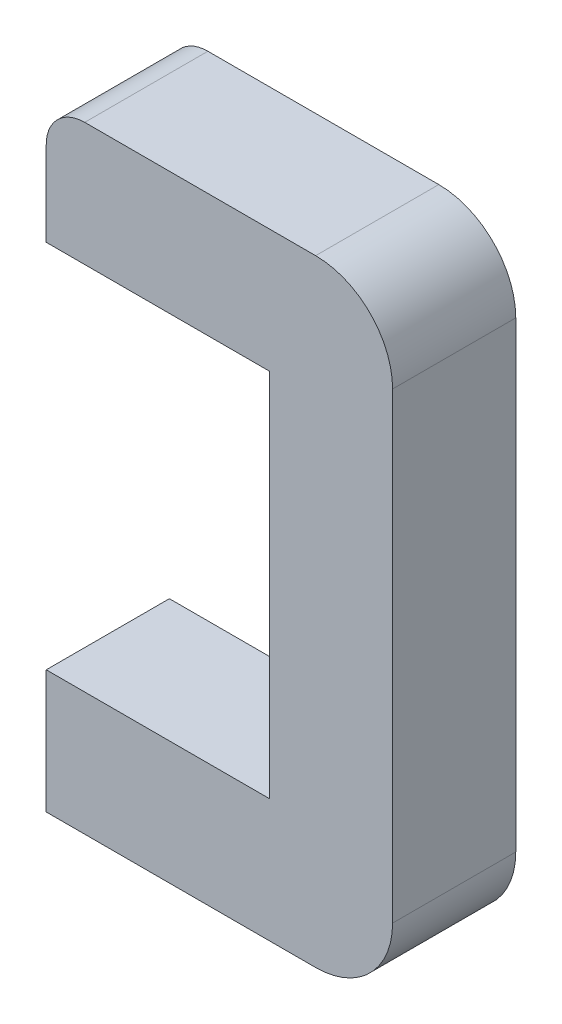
from build123d import *

# Parameters (mm, degrees)
BOSS_EXTRUDE1_DEPTH = 16
FILLET2_R           = 10
FILLET3_R           = 5
FILLET4_R           = 0.01


with BuildPart() as part:
    # Sketch1 → Boss-Extrude1 (new body)
    with BuildSketch(Plane.XY):
        Polygon((1.484974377, 31.197285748), (1.484974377, 15.197285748), (30.484974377, 15.197285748), (30.484974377, -32.896714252), (1.484974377, -32.896714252), (1.484974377, -48.896714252), (46.484974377, -48.896714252), (46.484974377, 31.197285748), align=None)
    extrude(amount=BOSS_EXTRUDE1_DEPTH)

    # Fillet2
    fillet2_edges = [part.edges().sort_by_distance(p)[0] for p in [
        (46.484974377, 31.197285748, 8),
        (46.484974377, -48.896714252, 8),
    ]]
    fillet(fillet2_edges, radius=FILLET2_R)

    # Fillet3
    fillet3_edges = [part.edges().sort_by_distance(p)[0] for p in [
        (1.484974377, 31.197285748, 8),
    ]]
    fillet(fillet3_edges, radius=FILLET3_R)

    # Fillet4
    fillet4_edges = [part.edges().sort_by_distance(p)[0] for p in [
        (1.484974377, -48.896714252, 8),
    ]]
    fillet(fillet4_edges, radius=FILLET4_R)


solid = part.part
